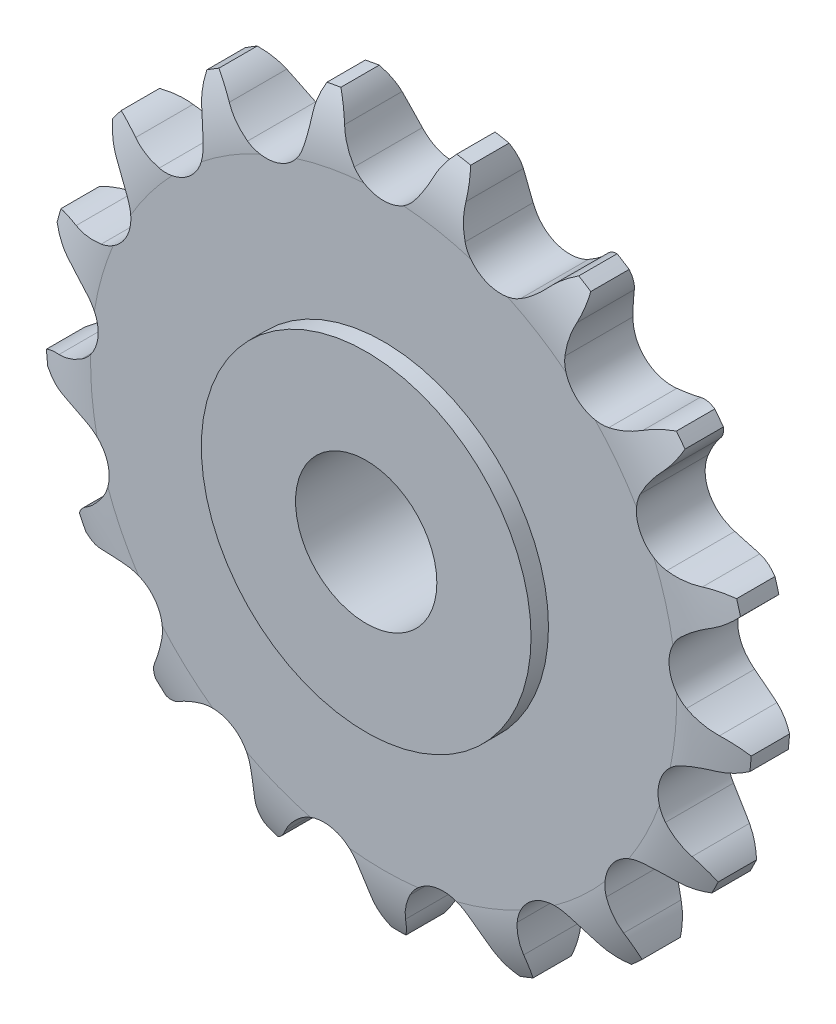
from build123d import *

# Parameters (mm, degrees)
CUT_EXTRUDE_1_DEPTH      = 54.31744555
CUT_EXTRUDE_1_DEPTH_BACK = 54.31744555


with BuildPart() as part:
    # Sketch 1 → Revolve 1 (revolve)
    with BuildSketch(Plane(origin=(0, 0, 0), x_dir=(0, 0, -1), z_dir=(1, 0, 0)), mode=Mode.PRIVATE) as revolve_1_sk:
        with BuildLine():
            Line((5.5, 17.5), (5.5, 7.5))
            Line((5.5, 7.5), (-5.5, 7.5))
            Line((-5.5, 7.5), (-5.5, 17.5))
            Line((-5.5, 17.5), (-3.65, 17.5))
            Line((-3.65, 17.5), (-3.65, 31.1))
            ThreePointArc((-3.65, 31.1), (-3.240423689, 34.400122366), (-2.036547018, 37.5))
            Line((-2.036547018, 37.5), (2.036547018, 37.5))
            ThreePointArc((2.036547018, 37.5), (3.240423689, 34.400122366), (3.65, 31.1))
            Line((3.65, 31.1), (3.65, 17.5))
            Line((3.65, 17.5), (5.5, 17.5))
        make_face()
    revolve(revolve_1_sk.sketch.rotate(Axis((0, 0, 10.5), (0, 0, -1)), 90), axis=Axis((0, 0, 10.5), (0, 0, -1)))

    # Sketch 2 → Cut-Extrude 1 (cut, two sides: drawn at the far end of the back side and taken through both)
    with BuildSketch(Plane.XY.offset(-CUT_EXTRUDE_1_DEPTH_BACK)):
        with BuildLine():
            ThreePointArc((-29.877013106, -11.776774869), (-29.278452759, -8.330440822), (-31.601616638, -5.715406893))
            ThreePointArc((-31.601616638, -5.715406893), (-33.136383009, -5.211268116), (-34.730784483, -4.951368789))
            ThreePointArc((-34.730784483, -4.951368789), (-36.034146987, -4.708616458), (-37.262854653, -4.210660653))
            ThreePointArc((-37.262854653, -4.210660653), (-36.068461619, -10.262362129), (-33.898144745, -16.036389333))
            ThreePointArc((-33.898144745, -16.036389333), (-33.115616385, -14.96618754), (-32.135267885, -14.073663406))
            ThreePointArc((-32.135267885, -14.073663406), (-30.91650167, -13.013350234), (-29.877013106, -11.776774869))
        make_face()
        with BuildLine():
            ThreePointArc((31.601621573, -5.715404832), (29.278454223, -8.330435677), (29.877009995, -11.776770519))
            ThreePointArc((29.877009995, -11.776770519), (30.916499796, -13.013348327), (32.135267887, -14.073663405))
            ThreePointArc((32.135267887, -14.073663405), (33.115616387, -14.966187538), (33.898144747, -16.03638933))
            ThreePointArc((33.898144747, -16.03638933), (36.068461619, -10.262362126), (37.262854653, -4.21066065))
            ThreePointArc((37.262854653, -4.21066065), (36.034146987, -4.708616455), (34.730784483, -4.951368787))
            ThreePointArc((34.730784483, -4.951368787), (33.136385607, -5.21126748), (31.601621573, -5.715404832))
        make_face()
        with BuildLine():
            ThreePointArc((19.503436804, -25.513609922), (16.024860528, -25.881033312), (14.145417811, -28.831149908))
            ThreePointArc((14.145417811, -28.831149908), (14.080532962, -30.445291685), (14.2668838, -32.049952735))
            ThreePointArc((14.2668838, -32.049952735), (14.390080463, -33.369992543), (14.247385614, -34.688067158))
            ThreePointArc((14.247385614, -34.688067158), (19.741206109, -31.883142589), (24.700878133, -28.215538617))
            ThreePointArc((24.700878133, -28.215538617), (23.457381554, -27.755757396), (22.330643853, -27.057083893))
            ThreePointArc((22.330643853, -27.057083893), (20.977276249, -26.175011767), (19.503436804, -25.513609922))
        make_face()
        with BuildLine():
            ThreePointArc((-12.840254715, -35.233192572), (-11.846820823, -34.355256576), (-11.048559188, -33.296738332))
            ThreePointArc((-11.048559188, -33.296738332), (-10.10522096, -31.985335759), (-8.969830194, -30.836183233))
            ThreePointArc((-8.969830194, -30.836183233), (-5.593424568, -29.922193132), (-2.775194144, -31.994165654))
            ThreePointArc((-2.775194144, -31.994165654), (-2.131597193, -33.475866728), (-1.725694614, -35.039483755))
            ThreePointArc((-1.725694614, -35.039483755), (-1.363718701, -36.314887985), (-0.754516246, -37.492408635))
            ThreePointArc((-0.754516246, -37.492408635), (-6.890606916, -36.861491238), (-12.840254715, -35.233192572))
        make_face()
        with BuildLine():
            ThreePointArc((-14.266883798, -32.049952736), (-14.08053301, -30.445293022), (-14.145417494, -28.831152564))
            ThreePointArc((-14.145417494, -28.831152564), (-16.024857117, -25.881035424), (-19.503431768, -25.513608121))
            ThreePointArc((-19.503431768, -25.513608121), (-20.977273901, -26.175010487), (-22.330643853, -27.057083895))
            ThreePointArc((-22.330643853, -27.057083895), (-23.457381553, -27.755757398), (-24.70087813, -28.215538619))
            ThreePointArc((-24.70087813, -28.215538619), (-19.741206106, -31.883142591), (-14.247385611, -34.68806716))
            ThreePointArc((-14.247385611, -34.68806716), (-14.39008046, -33.369992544), (-14.266883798, -32.049952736))
        make_face()
        with BuildLine():
            ThreePointArc((-23.605223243, -21.774337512), (-24.292041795, -18.344501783), (-27.40298681, -16.745278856))
            ThreePointArc((-27.40298681, -16.745278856), (-29.016229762, -16.829605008), (-30.596851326, -17.163220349))
            ThreePointArc((-30.596851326, -17.163220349), (-31.899892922, -17.407689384), (-33.225511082, -17.387219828))
            ThreePointArc((-33.225511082, -17.387219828), (-29.925646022, -22.598798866), (-25.816066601, -27.198910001))
            ThreePointArc((-25.816066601, -27.198910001), (-25.472982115, -25.918294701), (-24.881251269, -24.731898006))
            ThreePointArc((-24.881251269, -24.731898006), (-24.127814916, -23.302916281), (-23.605223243, -21.774337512))
        make_face()
        with BuildLine():
            ThreePointArc((8.969834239, -30.836186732), (5.593429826, -29.922192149), (2.775196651, -31.99416093))
            ThreePointArc((2.775196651, -31.99416093), (2.131598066, -33.475864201), (1.725694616, -35.039483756))
            ThreePointArc((1.725694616, -35.039483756), (1.363718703, -36.314887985), (0.754516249, -37.492408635))
            ThreePointArc((0.754516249, -37.492408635), (6.89060692, -36.861491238), (12.840254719, -35.233192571))
            ThreePointArc((12.840254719, -35.233192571), (11.846820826, -34.355256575), (11.04855919, -33.296738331))
            ThreePointArc((11.04855919, -33.296738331), (10.105222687, -31.985337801), (8.969834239, -30.836186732))
        make_face()
        with BuildLine():
            ThreePointArc((27.402992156, -16.745278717), (24.292045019, -18.344497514), (23.605221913, -21.774332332))
            ThreePointArc((23.605221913, -21.774332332), (24.127813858, -23.302913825), (24.881251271, -24.731898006))
            ThreePointArc((24.881251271, -24.731898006), (25.472982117, -25.9182947), (25.816066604, -27.198909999))
            ThreePointArc((25.816066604, -27.198909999), (29.925646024, -22.598798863), (33.225511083, -17.387219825))
            ThreePointArc((33.225511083, -17.387219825), (31.899892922, -17.407689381), (30.596851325, -17.163220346))
            ThreePointArc((30.596851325, -17.163220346), (29.016232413, -16.829605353), (27.402992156, -16.745278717))
        make_face()
        with BuildLine():
            ThreePointArc((19.095707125, 32.273889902), (17.957868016, 31.593445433), (16.978696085, 30.699630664))
            ThreePointArc((16.978696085, 30.699630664), (15.810451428, 29.583896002), (14.483237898, 28.66293799))
            ThreePointArc((14.483237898, 28.66293799), (10.996376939, 28.3849209), (8.606854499, 30.939461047))
            ThreePointArc((8.606854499, 30.939461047), (8.246477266, 32.514195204), (8.134799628, 34.125774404))
            ThreePointArc((8.134799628, 34.125774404), (8.013341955, 35.445975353), (7.630881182, 36.715387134))
            ThreePointArc((7.630881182, 36.715387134), (13.54656248, 34.967708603), (19.095707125, 32.273889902))
        make_face()
        with BuildLine():
            ThreePointArc((19.202275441, 25.741036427), (20.507630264, 22.495802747), (23.85946197, 21.495444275))
            ThreePointArc((23.85946197, 21.495444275), (25.429741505, 21.874767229), (26.922148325, 22.493140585))
            ThreePointArc((26.922148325, 22.493140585), (28.158082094, 22.972880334), (29.464890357, 23.19634101))
            ThreePointArc((29.464890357, 23.19634101), (25.263586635, 27.712834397), (20.378712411, 31.479486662))
            ThreePointArc((20.378712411, 31.479486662), (20.276782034, 30.157634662), (19.913126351, 28.882708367))
            ThreePointArc((19.913126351, 28.882708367), (19.435093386, 27.339614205), (19.202275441, 25.741036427))
        make_face()
        with BuildLine():
            ThreePointArc((-8.606855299, 30.939458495), (-8.246477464, 32.514193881), (-8.13479963, 34.125774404))
            ThreePointArc((-8.13479963, 34.125774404), (-8.013341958, 35.445975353), (-7.630881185, 36.715387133))
            ThreePointArc((-7.630881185, 36.715387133), (-13.546562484, 34.967708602), (-19.095707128, 32.2738899))
            ThreePointArc((-19.095707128, 32.2738899), (-17.957868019, 31.593445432), (-16.978696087, 30.699630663))
            ThreePointArc((-16.978696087, 30.699630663), (-15.810452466, 29.583896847), (-14.483240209, 28.662939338))
            ThreePointArc((-14.483240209, 28.662939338), (-10.996379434, 28.384919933), (-8.606855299, 30.939458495))
        make_face()
        with BuildLine():
            ThreePointArc((3.150967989, 31.959340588), (4.055870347, 33.297554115), (4.742176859, 34.759965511))
            ThreePointArc((4.742176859, 34.759965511), (5.332344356, 35.947140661), (6.147542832, 36.992671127))
            ThreePointArc((6.147542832, 36.992671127), (-2e-09, 37.5), (-6.147542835, 36.992671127))
            ThreePointArc((-6.147542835, 36.992671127), (-5.332344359, 35.947140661), (-4.742176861, 34.759965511))
            ThreePointArc((-4.742176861, 34.759965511), (-4.055871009, 33.297555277), (-3.150969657, 31.959342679))
            ThreePointArc((-3.150969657, 31.959342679), (-1.338e-06, 30.4405), (3.150967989, 31.959340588))
        make_face()
        with BuildLine():
            ThreePointArc((-30.013341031, 11.42487193), (-27.249219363, 13.568496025), (-27.204321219, 17.066134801))
            ThreePointArc((-27.204321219, 17.066134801), (-27.998891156, 18.472663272), (-29.002075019, 19.73887252))
            ThreePointArc((-29.002075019, 19.73887252), (-29.801730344, 20.796338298), (-30.374285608, 21.992107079))
            ThreePointArc((-30.374285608, 21.992107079), (-33.568623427, 16.71518834), (-35.854676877, 10.985997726))
            ThreePointArc((-35.854676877, 10.985997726), (-34.555391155, 11.249700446), (-33.229615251, 11.248827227))
            ThreePointArc((-33.229615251, 11.248827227), (-31.614607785, 11.211330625), (-30.013341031, 11.42487193))
        make_face()
        with BuildLine():
            ThreePointArc((-32.113746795, -0.188693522), (-30.31064644, 2.808692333), (-31.532273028, 6.086362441))
            ThreePointArc((-31.532273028, 6.086362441), (-32.781284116, 7.110879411), (-34.174132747, 7.929192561))
            ThreePointArc((-34.174132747, 7.929192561), (-35.30178983, 8.626381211), (-36.267643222, 9.534571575))
            ThreePointArc((-36.267643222, 9.534571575), (-37.340031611, 3.460063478), (-37.402090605, -2.708065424))
            ThreePointArc((-37.402090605, -2.708065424), (-36.285803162, -1.992813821), (-35.049238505, -1.514702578))
            ThreePointArc((-35.049238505, -1.514702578), (-33.529743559, -0.966259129), (-32.113746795, -0.188693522))
        make_face()
        with BuildLine():
            ThreePointArc((-26.922148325, 22.493140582), (-25.429742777, 21.874767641), (-23.859464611, 21.495444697))
            ThreePointArc((-23.859464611, 21.495444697), (-20.507633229, 22.495800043), (-19.202275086, 25.74103109))
            ThreePointArc((-19.202275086, 25.74103109), (-19.435092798, 27.339611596), (-19.913126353, 28.882708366))
            ThreePointArc((-19.913126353, 28.882708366), (-20.276782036, 30.15763466), (-20.378712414, 31.47948666))
            ThreePointArc((-20.378712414, 31.47948666), (-25.263586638, 27.712834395), (-29.464890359, 23.196341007))
            ThreePointArc((-29.464890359, 23.196341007), (-28.158082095, 22.972880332), (-26.922148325, 22.493140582))
        make_face()
        with BuildLine():
            ThreePointArc((27.204323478, 17.066139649), (27.249216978, 13.568500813), (30.013335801, 11.424873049))
            ThreePointArc((30.013335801, 11.424873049), (31.614605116, 11.211330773), (33.229615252, 11.248827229))
            ThreePointArc((33.229615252, 11.248827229), (34.555391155, 11.249700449), (35.854676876, 10.985997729))
            ThreePointArc((35.854676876, 10.985997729), (33.568623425, 16.715188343), (30.374285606, 21.992107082))
            ThreePointArc((30.374285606, 21.992107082), (29.801730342, 20.7963383), (29.002075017, 19.73887252))
            ThreePointArc((29.002075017, 19.73887252), (27.998892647, 18.472665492), (27.204323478, 17.066139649))
        make_face()
        with BuildLine():
            ThreePointArc((34.174132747, 7.929192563), (32.781285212, 7.110880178), (31.532274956, 6.086364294))
            ThreePointArc((31.532274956, 6.086364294), (30.31064607, 2.808696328), (32.113742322, -0.18869059))
            ThreePointArc((32.113742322, -0.18869059), (33.529741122, -0.966258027), (35.049238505, -1.514702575))
            ThreePointArc((35.049238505, -1.514702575), (36.285803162, -1.992813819), (37.402090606, -2.708065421))
            ThreePointArc((37.402090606, -2.708065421), (37.340031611, 3.460063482), (36.267643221, 9.534571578))
            ThreePointArc((36.267643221, 9.534571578), (35.30178983, 8.626381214), (34.174132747, 7.929192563))
        make_face()
    extrude(amount=CUT_EXTRUDE_1_DEPTH + CUT_EXTRUDE_1_DEPTH_BACK, mode=Mode.SUBTRACT)


solid = part.part
